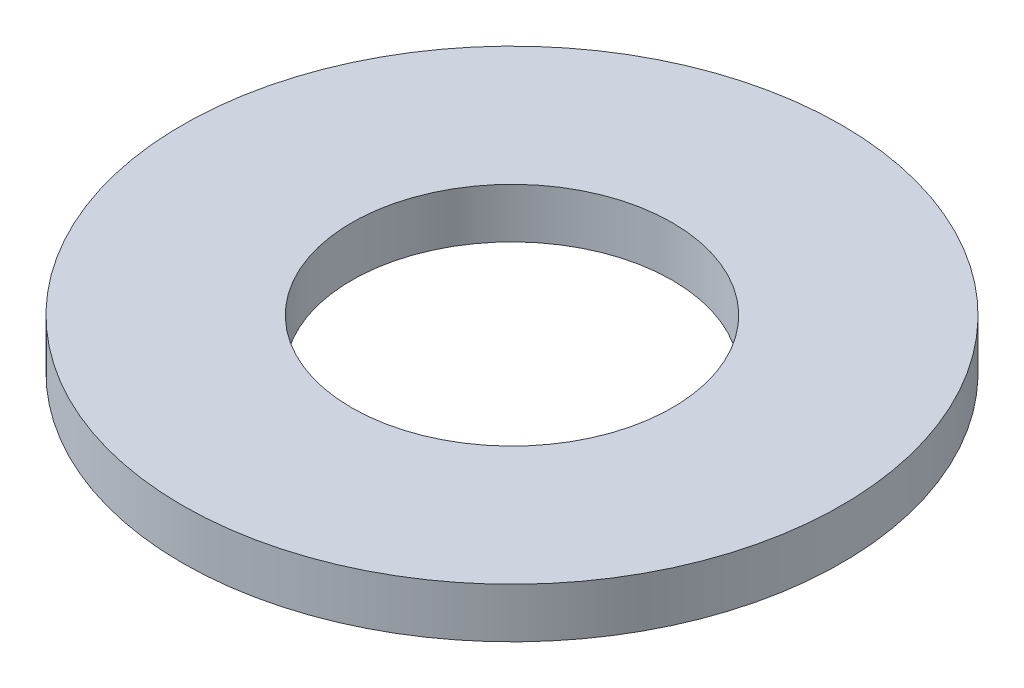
from build123d import *

# Parameters (mm, degrees)
SKETCH1_R          = 4.699
EXTRUDE1_DEPTH     = 0.7112
SKETCH2_R          = 2.286
CUT_EXTRUDE1_DEPTH = 7.683338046


with BuildPart() as part:
    # Sketch1 → Extrude1 (new body)
    with BuildSketch(Plane(origin=(0, 0, 0), x_dir=(1, 0, 0), z_dir=(0, 1, 0))):
        with Locations(Location((0, 0, 0), (0, 0, 270))):
            Circle(SKETCH1_R)
    extrude(amount=EXTRUDE1_DEPTH)

    # Sketch2 → Cut-Extrude1 (cut, through all)
    with BuildSketch(Plane.XZ):
        with Locations(Location((0, 0, 0), (0, 0, 270))):
            Circle(SKETCH2_R)
    extrude(amount=-CUT_EXTRUDE1_DEPTH, mode=Mode.SUBTRACT)


solid = part.part
